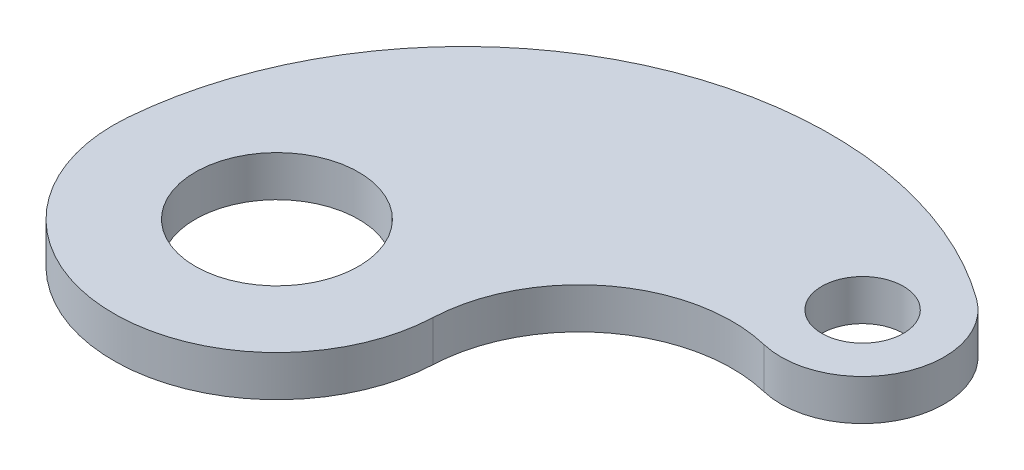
from build123d import *

# Parameters (mm, degrees)
CROQUIS4_R              = 40
CROQUIS4_R_2            = 20
SALIENTE_EXTRUIR2_DEPTH = 20


with BuildPart() as part:
    # Croquis4 → Saliente-Extruir2 (new body)
    with BuildSketch(Plane(origin=(0, 0, 0), x_dir=(1, 0, 0), z_dir=(0, 1, 0))):
        with BuildLine():
            ThreePointArc((-79.722697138, 6.655190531), (-5.078826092, -79.838621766), (79.923379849, -3.500479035))
            ThreePointArc((79.923379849, -3.500479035), (109.764419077, 53.152375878), (172.469235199, 66.119242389))
            ThreePointArc((172.469235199, 66.119242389), (218.184271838, 88.238889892), (205.354467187, 137.376853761))
            ThreePointArc((205.354467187, 137.376853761), (24.626451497, 155.299352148), (-79.722697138, 6.655190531))
        make_face()
        with Locations(Location((0, 0, 0), (0, 0, 270))):
            Circle(CROQUIS4_R, mode=Mode.SUBTRACT)
        with Locations(Location((181.865334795, 105, 0), (0, 0, 270))):
            Circle(CROQUIS4_R_2, mode=Mode.SUBTRACT)
    extrude(amount=SALIENTE_EXTRUIR2_DEPTH)


solid = part.part
